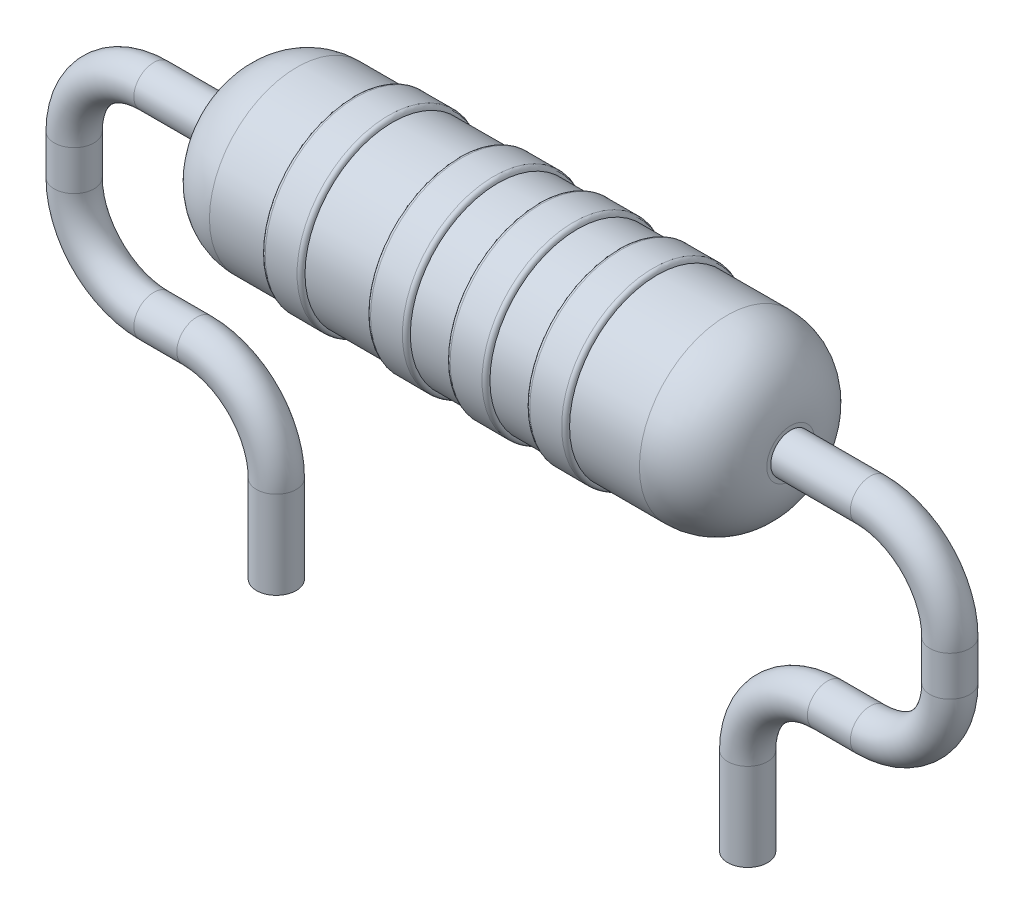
ISO-10303-21;
HEADER;
FILE_DESCRIPTION(('STEP AP214'),'2;1');
FILE_NAME('part.step','',(''),(''),'','','');
FILE_SCHEMA(('AUTOMOTIVE_DESIGN { 1 0 10303 214 1 1 1 1 }'));
ENDSEC;
DATA;
#1=APPLICATION_CONTEXT('core data for automotive mechanical design processes');
#2=APPLICATION_PROTOCOL_DEFINITION('international standard','automotive_design',2000,#1);
#3=PRODUCT_CONTEXT('',#1,'mechanical');
#4=PRODUCT('Part','Part','',(#3));
#5=PRODUCT_RELATED_PRODUCT_CATEGORY('part','',(#4));
#6=PRODUCT_DEFINITION_FORMATION('','',#4);
#7=PRODUCT_DEFINITION_CONTEXT('part definition',#1,'design');
#8=PRODUCT_DEFINITION('design','',#6,#7);
#9=PRODUCT_DEFINITION_SHAPE('','',#8);
#10=(LENGTH_UNIT() NAMED_UNIT(*) SI_UNIT(.MILLI.,.METRE.));
#11=(NAMED_UNIT(*) PLANE_ANGLE_UNIT() SI_UNIT($,.RADIAN.));
#12=(NAMED_UNIT(*) SI_UNIT($,.STERADIAN.) SOLID_ANGLE_UNIT());
#13=UNCERTAINTY_MEASURE_WITH_UNIT(LENGTH_MEASURE(1.E-05),#10,'distance_accuracy_value','');
#14=(GEOMETRIC_REPRESENTATION_CONTEXT(3) GLOBAL_UNCERTAINTY_ASSIGNED_CONTEXT((#13)) GLOBAL_UNIT_ASSIGNED_CONTEXT((#10,
#11,#12)) REPRESENTATION_CONTEXT('',''));
#15=CARTESIAN_POINT('',(0.,0.,0.));
#16=DIRECTION('',(0.,0.,1.));
#17=DIRECTION('',(1.,0.,0.));
#18=AXIS2_PLACEMENT_3D('',#15,#16,#17);
#19=CARTESIAN_POINT('',(-54.2686615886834,0.,0.));
#20=DIRECTION('',(-1.,0.,0.));
#21=DIRECTION('',(0.,0.,1.));
#22=AXIS2_PLACEMENT_3D('',#19,#20,#21);
#23=CYLINDRICAL_SURFACE('',#22,1.1);
#24=CARTESIAN_POINT('',(0.322975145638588,0.,0.));
#25=DIRECTION('',(-1.,0.,0.));
#26=DIRECTION('',(0.,0.,1.));
#27=AXIS2_PLACEMENT_3D('',#24,#25,#26);
#28=CIRCLE('',#27,1.1);
#29=CARTESIAN_POINT('',(0.322975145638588,0.,1.1));
#30=VERTEX_POINT('',#29);
#31=EDGE_CURVE('E86',#30,#30,#28,.T.);
#32=ORIENTED_EDGE('',*,*,#31,.T.);
#33=EDGE_LOOP('',(#32));
#34=FACE_BOUND('',#33,.T.);
#35=CARTESIAN_POINT('',(-0.177024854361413,0.,0.));
#36=DIRECTION('',(1.,0.,0.));
#37=DIRECTION('',(0.,0.,-1.));
#38=AXIS2_PLACEMENT_3D('',#35,#36,#37);
#39=CIRCLE('',#38,1.1);
#40=CARTESIAN_POINT('',(-0.177024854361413,0.,-1.1));
#41=VERTEX_POINT('',#40);
#42=EDGE_CURVE('E95',#41,#41,#39,.T.);
#43=ORIENTED_EDGE('',*,*,#42,.T.);
#44=EDGE_LOOP('',(#43));
#45=FACE_BOUND('',#44,.T.);
#46=ADVANCED_FACE('F39',(#34,#45),#23,.T.);
#47=CARTESIAN_POINT('',(4.3261723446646,0.,0.));
#48=DIRECTION('',(1.,0.,0.));
#49=DIRECTION('',(0.,0.,-1.));
#50=AXIS2_PLACEMENT_3D('',#47,#48,#49);
#51=CYLINDRICAL_SURFACE('',#50,1.15);
#52=CARTESIAN_POINT('',(-0.627024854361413,0.,0.));
#53=DIRECTION('',(-1.,0.,0.));
#54=DIRECTION('',(0.,0.,1.));
#55=AXIS2_PLACEMENT_3D('',#52,#53,#54);
#56=CIRCLE('',#55,1.15);
#57=CARTESIAN_POINT('',(-0.627024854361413,0.,1.15));
#58=VERTEX_POINT('',#57);
#59=EDGE_CURVE('E62',#58,#58,#56,.F.);
#60=ORIENTED_EDGE('',*,*,#59,.T.);
#61=EDGE_LOOP('',(#60));
#62=FACE_BOUND('',#61,.T.);
#63=CARTESIAN_POINT('',(-0.227024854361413,0.,0.));
#64=DIRECTION('',(1.,0.,0.));
#65=DIRECTION('',(0.,0.,-1.));
#66=AXIS2_PLACEMENT_3D('',#63,#64,#65);
#67=CIRCLE('',#66,1.15);
#68=CARTESIAN_POINT('',(-0.227024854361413,0.,-1.15));
#69=VERTEX_POINT('',#68);
#70=EDGE_CURVE('E65',#69,#69,#67,.F.);
#71=ORIENTED_EDGE('',*,*,#70,.T.);
#72=EDGE_LOOP('',(#71));
#73=FACE_BOUND('',#72,.T.);
#74=ADVANCED_FACE('F204',(#62,#73),#51,.T.);
#75=CARTESIAN_POINT('',(-1.5,0.,0.));
#76=DIRECTION('',(1.,0.,0.));
#77=DIRECTION('',(0.,0.,-1.));
#78=AXIS2_PLACEMENT_3D('',#75,#76,#77);
#79=CIRCLE('',#78,1.1);
#80=CARTESIAN_POINT('',(-1.5,0.,-1.1));
#81=VERTEX_POINT('',#80);
#82=EDGE_CURVE('E79',#81,#81,#79,.T.);
#83=ORIENTED_EDGE('',*,*,#82,.T.);
#84=EDGE_LOOP('',(#83));
#85=FACE_BOUND('',#84,.T.);
#86=CARTESIAN_POINT('',(-0.677024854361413,0.,0.));
#87=DIRECTION('',(-1.,0.,0.));
#88=DIRECTION('',(0.,0.,1.));
#89=AXIS2_PLACEMENT_3D('',#86,#87,#88);
#90=CIRCLE('',#89,1.1);
#91=CARTESIAN_POINT('',(-0.677024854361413,0.,1.1));
#92=VERTEX_POINT('',#91);
#93=EDGE_CURVE('E92',#92,#92,#90,.T.);
#94=ORIENTED_EDGE('',*,*,#93,.T.);
#95=EDGE_LOOP('',(#94));
#96=FACE_BOUND('',#95,.T.);
#97=ADVANCED_FACE('F207',(#85,#96),#23,.T.);
#98=CARTESIAN_POINT('',(4.3261723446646,0.,0.));
#99=DIRECTION('',(1.,0.,0.));
#100=DIRECTION('',(0.,0.,-1.));
#101=AXIS2_PLACEMENT_3D('',#98,#99,#100);
#102=CYLINDRICAL_SURFACE('',#101,1.15);
#103=CARTESIAN_POINT('',(0.372975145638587,0.,0.));
#104=DIRECTION('',(-1.,0.,0.));
#105=DIRECTION('',(0.,0.,1.));
#106=AXIS2_PLACEMENT_3D('',#103,#104,#105);
#107=CIRCLE('',#106,1.15);
#108=CARTESIAN_POINT('',(0.372975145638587,0.,1.15));
#109=VERTEX_POINT('',#108);
#110=EDGE_CURVE('E54',#109,#109,#107,.F.);
#111=ORIENTED_EDGE('',*,*,#110,.T.);
#112=EDGE_LOOP('',(#111));
#113=FACE_BOUND('',#112,.T.);
#114=CARTESIAN_POINT('',(0.772975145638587,0.,0.));
#115=DIRECTION('',(1.,0.,0.));
#116=DIRECTION('',(0.,0.,-1.));
#117=AXIS2_PLACEMENT_3D('',#114,#115,#116);
#118=CIRCLE('',#117,1.15);
#119=CARTESIAN_POINT('',(0.772975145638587,0.,-1.15));
#120=VERTEX_POINT('',#119);
#121=EDGE_CURVE('E59',#120,#120,#118,.F.);
#122=ORIENTED_EDGE('',*,*,#121,.T.);
#123=EDGE_LOOP('',(#122));
#124=FACE_BOUND('',#123,.T.);
#125=ADVANCED_FACE('F218',(#113,#124),#102,.T.);
#126=CARTESIAN_POINT('',(1.32297514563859,0.,0.));
#127=DIRECTION('',(-1.,0.,0.));
#128=DIRECTION('',(0.,0.,1.));
#129=AXIS2_PLACEMENT_3D('',#126,#127,#128);
#130=CIRCLE('',#129,1.1);
#131=CARTESIAN_POINT('',(1.32297514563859,0.,1.1));
#132=VERTEX_POINT('',#131);
#133=EDGE_CURVE('E78',#132,#132,#130,.T.);
#134=ORIENTED_EDGE('',*,*,#133,.T.);
#135=EDGE_LOOP('',(#134));
#136=FACE_BOUND('',#135,.T.);
#137=CARTESIAN_POINT('',(0.822975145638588,0.,0.));
#138=DIRECTION('',(1.,0.,0.));
#139=DIRECTION('',(0.,0.,-1.));
#140=AXIS2_PLACEMENT_3D('',#137,#138,#139);
#141=CIRCLE('',#140,1.1);
#142=CARTESIAN_POINT('',(0.822975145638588,0.,-1.1));
#143=VERTEX_POINT('',#142);
#144=EDGE_CURVE('E89',#143,#143,#141,.T.);
#145=ORIENTED_EDGE('',*,*,#144,.T.);
#146=EDGE_LOOP('',(#145));
#147=FACE_BOUND('',#146,.T.);
#148=ADVANCED_FACE('F208',(#136,#147),#23,.T.);
#149=CARTESIAN_POINT('',(4.3261723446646,0.,0.));
#150=DIRECTION('',(1.,0.,0.));
#151=DIRECTION('',(0.,0.,-1.));
#152=AXIS2_PLACEMENT_3D('',#149,#150,#151);
#153=CYLINDRICAL_SURFACE('',#152,1.15);
#154=CARTESIAN_POINT('',(1.37297514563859,0.,0.));
#155=DIRECTION('',(-1.,0.,0.));
#156=DIRECTION('',(0.,0.,1.));
#157=AXIS2_PLACEMENT_3D('',#154,#155,#156);
#158=CIRCLE('',#157,1.15);
#159=CARTESIAN_POINT('',(1.37297514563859,0.,1.15));
#160=VERTEX_POINT('',#159);
#161=EDGE_CURVE('E46',#160,#160,#158,.F.);
#162=ORIENTED_EDGE('',*,*,#161,.T.);
#163=EDGE_LOOP('',(#162));
#164=FACE_BOUND('',#163,.T.);
#165=CARTESIAN_POINT('',(1.77297514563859,0.,0.));
#166=DIRECTION('',(1.,0.,0.));
#167=DIRECTION('',(0.,0.,-1.));
#168=AXIS2_PLACEMENT_3D('',#165,#166,#167);
#169=CIRCLE('',#168,1.15);
#170=CARTESIAN_POINT('',(1.77297514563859,0.,-1.15));
#171=VERTEX_POINT('',#170);
#172=EDGE_CURVE('E50',#171,#171,#169,.F.);
#173=ORIENTED_EDGE('',*,*,#172,.T.);
#174=EDGE_LOOP('',(#173));
#175=FACE_BOUND('',#174,.T.);
#176=ADVANCED_FACE('F222',(#164,#175),#153,.T.);
#177=CARTESIAN_POINT('',(3.5,0.299999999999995,0.));
#178=DIRECTION('',(-1.,0.,0.));
#179=DIRECTION('',(0.,0.,1.));
#180=AXIS2_PLACEMENT_3D('',#177,#178,#179);
#181=PLANE('',#180);
#182=CARTESIAN_POINT('',(3.5,0.,0.));
#183=DIRECTION('',(-1.,0.,0.));
#184=DIRECTION('',(0.,0.,1.));
#185=AXIS2_PLACEMENT_3D('',#182,#183,#184);
#186=CIRCLE('',#185,0.25);
#187=CARTESIAN_POINT('',(3.5,0.,0.25));
#188=VERTEX_POINT('',#187);
#189=EDGE_CURVE('E150',#188,#188,#186,.T.);
#190=ORIENTED_EDGE('',*,*,#189,.T.);
#191=EDGE_LOOP('',(#190));
#192=FACE_BOUND('',#191,.T.);
#193=CARTESIAN_POINT('',(3.5,0.,0.));
#194=DIRECTION('',(-1.,0.,0.));
#195=DIRECTION('',(0.,0.,1.));
#196=AXIS2_PLACEMENT_3D('',#193,#194,#195);
#197=CIRCLE('',#196,0.299999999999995);
#198=CARTESIAN_POINT('',(3.5,0.,0.299999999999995));
#199=VERTEX_POINT('',#198);
#200=EDGE_CURVE('E74',#199,#199,#197,.T.);
#201=ORIENTED_EDGE('',*,*,#200,.F.);
#202=EDGE_LOOP('',(#201));
#203=FACE_BOUND('',#202,.T.);
#204=ADVANCED_FACE('F229',(#192,#203),#181,.F.);
#205=CARTESIAN_POINT('',(2.7,0.,0.));
#206=DIRECTION('',(-1.,0.,0.));
#207=DIRECTION('',(0.,0.,1.));
#208=AXIS2_PLACEMENT_3D('',#205,#206,#207);
#209=DEGENERATE_TOROIDAL_SURFACE('',#208,0.3,0.8,.T.);
#210=CARTESIAN_POINT('',(2.69999999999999,0.,0.));
#211=DIRECTION('',(-1.,0.,0.));
#212=DIRECTION('',(0.,0.,1.));
#213=AXIS2_PLACEMENT_3D('',#210,#211,#212);
#214=CIRCLE('',#213,1.1);
#215=CARTESIAN_POINT('',(2.69999999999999,0.,1.1));
#216=VERTEX_POINT('',#215);
#217=EDGE_CURVE('E103',#216,#216,#214,.T.);
#218=ORIENTED_EDGE('',*,*,#217,.F.);
#219=EDGE_LOOP('',(#218));
#220=FACE_BOUND('',#219,.T.);
#221=ORIENTED_EDGE('',*,*,#200,.T.);
#222=EDGE_LOOP('',(#221));
#223=FACE_BOUND('',#222,.T.);
#224=ADVANCED_FACE('F236',(#220,#223),#209,.T.);
#225=CARTESIAN_POINT('',(1.82297514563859,0.,0.));
#226=DIRECTION('',(1.,0.,0.));
#227=DIRECTION('',(0.,0.,-1.));
#228=AXIS2_PLACEMENT_3D('',#225,#226,#227);
#229=CIRCLE('',#228,1.1);
#230=CARTESIAN_POINT('',(1.82297514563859,0.,-1.1));
#231=VERTEX_POINT('',#230);
#232=EDGE_CURVE('E83',#231,#231,#229,.T.);
#233=ORIENTED_EDGE('',*,*,#232,.T.);
#234=EDGE_LOOP('',(#233));
#235=FACE_BOUND('',#234,.T.);
#236=ORIENTED_EDGE('',*,*,#217,.T.);
#237=EDGE_LOOP('',(#236));
#238=FACE_BOUND('',#237,.T.);
#239=ADVANCED_FACE('F224',(#235,#238),#23,.T.);
#240=CARTESIAN_POINT('',(4.3261723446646,0.,0.));
#241=DIRECTION('',(1.,0.,0.));
#242=DIRECTION('',(0.,0.,-1.));
#243=AXIS2_PLACEMENT_3D('',#240,#241,#242);
#244=CYLINDRICAL_SURFACE('',#243,1.15);
#245=CARTESIAN_POINT('',(-1.95,0.,0.));
#246=DIRECTION('',(-1.,0.,0.));
#247=DIRECTION('',(0.,0.,1.));
#248=AXIS2_PLACEMENT_3D('',#245,#246,#247);
#249=CIRCLE('',#248,1.15);
#250=CARTESIAN_POINT('',(-1.95,0.,1.15));
#251=VERTEX_POINT('',#250);
#252=EDGE_CURVE('E68',#251,#251,#249,.F.);
#253=ORIENTED_EDGE('',*,*,#252,.T.);
#254=EDGE_LOOP('',(#253));
#255=FACE_BOUND('',#254,.T.);
#256=CARTESIAN_POINT('',(-1.55,0.,0.));
#257=DIRECTION('',(1.,0.,0.));
#258=DIRECTION('',(0.,0.,-1.));
#259=AXIS2_PLACEMENT_3D('',#256,#257,#258);
#260=CIRCLE('',#259,1.15);
#261=CARTESIAN_POINT('',(-1.55,0.,-1.15));
#262=VERTEX_POINT('',#261);
#263=EDGE_CURVE('E71',#262,#262,#260,.F.);
#264=ORIENTED_EDGE('',*,*,#263,.T.);
#265=EDGE_LOOP('',(#264));
#266=FACE_BOUND('',#265,.T.);
#267=ADVANCED_FACE('F235',(#255,#266),#244,.T.);
#268=CARTESIAN_POINT('',(-3.5,0.,0.));
#269=DIRECTION('',(1.,0.,0.));
#270=DIRECTION('',(0.,0.,-1.));
#271=AXIS2_PLACEMENT_3D('',#268,#269,#270);
#272=PLANE('',#271);
#273=CARTESIAN_POINT('',(-3.5,0.,0.));
#274=DIRECTION('',(1.,0.,0.));
#275=DIRECTION('',(0.,0.,-1.));
#276=AXIS2_PLACEMENT_3D('',#273,#274,#275);
#277=CIRCLE('',#276,0.25);
#278=CARTESIAN_POINT('',(-3.5,0.,-0.25));
#279=VERTEX_POINT('',#278);
#280=EDGE_CURVE('E10',#279,#279,#277,.F.);
#281=ORIENTED_EDGE('',*,*,#280,.F.);
#282=EDGE_LOOP('',(#281));
#283=FACE_BOUND('',#282,.T.);
#284=CARTESIAN_POINT('',(-3.5,0.,0.));
#285=DIRECTION('',(-1.,0.,0.));
#286=DIRECTION('',(0.,0.,1.));
#287=AXIS2_PLACEMENT_3D('',#284,#285,#286);
#288=CIRCLE('',#287,0.299999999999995);
#289=CARTESIAN_POINT('',(-3.5,0.,0.299999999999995));
#290=VERTEX_POINT('',#289);
#291=EDGE_CURVE('E98',#290,#290,#288,.T.);
#292=ORIENTED_EDGE('',*,*,#291,.T.);
#293=EDGE_LOOP('',(#292));
#294=FACE_BOUND('',#293,.T.);
#295=ADVANCED_FACE('F242',(#283,#294),#272,.F.);
#296=CARTESIAN_POINT('',(-2.7,0.,0.));
#297=DIRECTION('',(-1.,0.,0.));
#298=DIRECTION('',(0.,0.,1.));
#299=AXIS2_PLACEMENT_3D('',#296,#297,#298);
#300=DEGENERATE_TOROIDAL_SURFACE('',#299,0.3,0.8,.T.);
#301=ORIENTED_EDGE('',*,*,#291,.F.);
#302=EDGE_LOOP('',(#301));
#303=FACE_BOUND('',#302,.T.);
#304=CARTESIAN_POINT('',(-2.69999999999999,0.,0.));
#305=DIRECTION('',(-1.,0.,0.));
#306=DIRECTION('',(0.,0.,1.));
#307=AXIS2_PLACEMENT_3D('',#304,#305,#306);
#308=CIRCLE('',#307,1.1);
#309=CARTESIAN_POINT('',(-2.69999999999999,0.,1.1));
#310=VERTEX_POINT('',#309);
#311=EDGE_CURVE('E106',#310,#310,#308,.T.);
#312=ORIENTED_EDGE('',*,*,#311,.T.);
#313=EDGE_LOOP('',(#312));
#314=FACE_BOUND('',#313,.T.);
#315=ADVANCED_FACE('F249',(#303,#314),#300,.T.);
#316=CARTESIAN_POINT('',(-2.,0.,0.));
#317=DIRECTION('',(-1.,0.,0.));
#318=DIRECTION('',(0.,0.,1.));
#319=AXIS2_PLACEMENT_3D('',#316,#317,#318);
#320=CIRCLE('',#319,1.1);
#321=CARTESIAN_POINT('',(-2.,0.,1.1));
#322=VERTEX_POINT('',#321);
#323=EDGE_CURVE('E75',#322,#322,#320,.T.);
#324=ORIENTED_EDGE('',*,*,#323,.T.);
#325=EDGE_LOOP('',(#324));
#326=FACE_BOUND('',#325,.T.);
#327=ORIENTED_EDGE('',*,*,#311,.F.);
#328=EDGE_LOOP('',(#327));
#329=FACE_BOUND('',#328,.T.);
#330=ADVANCED_FACE('F220',(#326,#329),#23,.T.);
#331=CARTESIAN_POINT('',(-1.95,0.,0.));
#332=DIRECTION('',(-1.,0.,0.));
#333=DIRECTION('',(0.,0.,1.));
#334=AXIS2_PLACEMENT_3D('',#331,#332,#333);
#335=TOROIDAL_SURFACE('',#334,1.1,0.05);
#336=ORIENTED_EDGE('',*,*,#323,.F.);
#337=EDGE_LOOP('',(#336));
#338=FACE_BOUND('',#337,.T.);
#339=ORIENTED_EDGE('',*,*,#252,.F.);
#340=EDGE_LOOP('',(#339));
#341=FACE_BOUND('',#340,.T.);
#342=ADVANCED_FACE('F248',(#338,#341),#335,.T.);
#343=CARTESIAN_POINT('',(-1.55,0.,0.));
#344=DIRECTION('',(1.,0.,0.));
#345=DIRECTION('',(0.,0.,-1.));
#346=AXIS2_PLACEMENT_3D('',#343,#344,#345);
#347=TOROIDAL_SURFACE('',#346,1.1,0.05);
#348=ORIENTED_EDGE('',*,*,#263,.F.);
#349=EDGE_LOOP('',(#348));
#350=FACE_BOUND('',#349,.T.);
#351=ORIENTED_EDGE('',*,*,#82,.F.);
#352=EDGE_LOOP('',(#351));
#353=FACE_BOUND('',#352,.T.);
#354=ADVANCED_FACE('F255',(#350,#353),#347,.T.);
#355=CARTESIAN_POINT('',(-0.627024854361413,0.,0.));
#356=DIRECTION('',(-1.,0.,0.));
#357=DIRECTION('',(0.,0.,1.));
#358=AXIS2_PLACEMENT_3D('',#355,#356,#357);
#359=TOROIDAL_SURFACE('',#358,1.1,0.05);
#360=ORIENTED_EDGE('',*,*,#93,.F.);
#361=EDGE_LOOP('',(#360));
#362=FACE_BOUND('',#361,.T.);
#363=ORIENTED_EDGE('',*,*,#59,.F.);
#364=EDGE_LOOP('',(#363));
#365=FACE_BOUND('',#364,.T.);
#366=ADVANCED_FACE('F270',(#362,#365),#359,.T.);
#367=CARTESIAN_POINT('',(-0.227024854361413,0.,0.));
#368=DIRECTION('',(1.,0.,0.));
#369=DIRECTION('',(0.,0.,-1.));
#370=AXIS2_PLACEMENT_3D('',#367,#368,#369);
#371=TOROIDAL_SURFACE('',#370,1.1,0.05);
#372=ORIENTED_EDGE('',*,*,#70,.F.);
#373=EDGE_LOOP('',(#372));
#374=FACE_BOUND('',#373,.T.);
#375=ORIENTED_EDGE('',*,*,#42,.F.);
#376=EDGE_LOOP('',(#375));
#377=FACE_BOUND('',#376,.T.);
#378=ADVANCED_FACE('F278',(#374,#377),#371,.T.);
#379=CARTESIAN_POINT('',(0.372975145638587,0.,0.));
#380=DIRECTION('',(-1.,0.,0.));
#381=DIRECTION('',(0.,0.,1.));
#382=AXIS2_PLACEMENT_3D('',#379,#380,#381);
#383=TOROIDAL_SURFACE('',#382,1.1,0.05);
#384=ORIENTED_EDGE('',*,*,#31,.F.);
#385=EDGE_LOOP('',(#384));
#386=FACE_BOUND('',#385,.T.);
#387=ORIENTED_EDGE('',*,*,#110,.F.);
#388=EDGE_LOOP('',(#387));
#389=FACE_BOUND('',#388,.T.);
#390=ADVANCED_FACE('F286',(#386,#389),#383,.T.);
#391=CARTESIAN_POINT('',(0.772975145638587,0.,0.));
#392=DIRECTION('',(1.,0.,0.));
#393=DIRECTION('',(0.,0.,-1.));
#394=AXIS2_PLACEMENT_3D('',#391,#392,#393);
#395=TOROIDAL_SURFACE('',#394,1.1,0.05);
#396=ORIENTED_EDGE('',*,*,#121,.F.);
#397=EDGE_LOOP('',(#396));
#398=FACE_BOUND('',#397,.T.);
#399=ORIENTED_EDGE('',*,*,#144,.F.);
#400=EDGE_LOOP('',(#399));
#401=FACE_BOUND('',#400,.T.);
#402=ADVANCED_FACE('F292',(#398,#401),#395,.T.);
#403=CARTESIAN_POINT('',(1.37297514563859,0.,0.));
#404=DIRECTION('',(-1.,0.,0.));
#405=DIRECTION('',(0.,0.,1.));
#406=AXIS2_PLACEMENT_3D('',#403,#404,#405);
#407=TOROIDAL_SURFACE('',#406,1.1,0.05);
#408=ORIENTED_EDGE('',*,*,#133,.F.);
#409=EDGE_LOOP('',(#408));
#410=FACE_BOUND('',#409,.T.);
#411=ORIENTED_EDGE('',*,*,#161,.F.);
#412=EDGE_LOOP('',(#411));
#413=FACE_BOUND('',#412,.T.);
#414=ADVANCED_FACE('F297',(#410,#413),#407,.T.);
#415=CARTESIAN_POINT('',(1.77297514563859,0.,0.));
#416=DIRECTION('',(1.,0.,0.));
#417=DIRECTION('',(0.,0.,-1.));
#418=AXIS2_PLACEMENT_3D('',#415,#416,#417);
#419=TOROIDAL_SURFACE('',#418,1.1,0.05);
#420=ORIENTED_EDGE('',*,*,#172,.F.);
#421=EDGE_LOOP('',(#420));
#422=FACE_BOUND('',#421,.T.);
#423=ORIENTED_EDGE('',*,*,#232,.F.);
#424=EDGE_LOOP('',(#423));
#425=FACE_BOUND('',#424,.T.);
#426=ADVANCED_FACE('F41',(#422,#425),#419,.T.);
#427=CARTESIAN_POINT('',(-2.96,-3.50000000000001,0.));
#428=DIRECTION('',(0.,-1.,0.));
#429=DIRECTION('',(1.,0.,0.));
#430=AXIS2_PLACEMENT_3D('',#427,#428,#429);
#431=CYLINDRICAL_SURFACE('',#430,0.25);
#432=CARTESIAN_POINT('',(-2.96,-3.50000000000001,0.));
#433=DIRECTION('',(0.,-1.,0.));
#434=DIRECTION('',(0.,0.,1.));
#435=AXIS2_PLACEMENT_3D('',#432,#433,#434);
#436=CIRCLE('',#435,0.25);
#437=CARTESIAN_POINT('',(-2.71,-3.50000000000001,0.));
#438=VERTEX_POINT('',#437);
#439=EDGE_CURVE('E113',#438,#438,#436,.T.);
#440=ORIENTED_EDGE('',*,*,#439,.T.);
#441=EDGE_LOOP('',(#440));
#442=FACE_BOUND('',#441,.T.);
#443=CARTESIAN_POINT('',(-2.96,-4.6,0.));
#444=DIRECTION('',(0.,-1.,0.));
#445=DIRECTION('',(0.,0.,1.));
#446=AXIS2_PLACEMENT_3D('',#443,#444,#445);
#447=CIRCLE('',#446,0.25);
#448=CARTESIAN_POINT('',(-2.96,-4.6,0.25));
#449=VERTEX_POINT('',#448);
#450=EDGE_CURVE('E82',#449,#449,#447,.T.);
#451=ORIENTED_EDGE('',*,*,#450,.F.);
#452=EDGE_LOOP('',(#451));
#453=FACE_BOUND('',#452,.T.);
#454=ADVANCED_FACE('F304',(#442,#453),#431,.T.);
#455=CARTESIAN_POINT('',(-3.96,-3.5,0.));
#456=DIRECTION('',(0.,0.,-1.));
#457=DIRECTION('',(-1.,0.,0.));
#458=AXIS2_PLACEMENT_3D('',#455,#456,#457);
#459=TOROIDAL_SURFACE('',#458,1.,0.25);
#460=CARTESIAN_POINT('',(-3.96000000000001,-2.5,0.));
#461=DIRECTION('',(1.,0.,0.));
#462=DIRECTION('',(0.,0.,1.));
#463=AXIS2_PLACEMENT_3D('',#460,#461,#462);
#464=CIRCLE('',#463,0.25);
#465=CARTESIAN_POINT('',(-3.96000000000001,-2.25,0.));
#466=VERTEX_POINT('',#465);
#467=EDGE_CURVE('E116',#466,#466,#464,.T.);
#468=CARTESIAN_POINT('',(-3.96,-3.5,0.));
#469=DIRECTION('',(0.,0.,-1.));
#470=DIRECTION('',(-1.,0.,0.));
#471=AXIS2_PLACEMENT_3D('',#468,#469,#470);
#472=CIRCLE('',#471,1.25);
#473=EDGE_CURVE('',#466,#438,#472,.T.);
#474=ORIENTED_EDGE('',*,*,#467,.T.);
#475=ORIENTED_EDGE('',*,*,#439,.F.);
#476=ORIENTED_EDGE('',*,*,#473,.T.);
#477=ORIENTED_EDGE('',*,*,#473,.F.);
#478=EDGE_LOOP('',(#474,#476,#475,#477));
#479=FACE_BOUND('',#478,.T.);
#480=ADVANCED_FACE('F311',(#479),#459,.T.);
#481=CARTESIAN_POINT('',(-4.49999999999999,-2.5,0.));
#482=DIRECTION('',(1.,0.,0.));
#483=DIRECTION('',(0.,1.,0.));
#484=AXIS2_PLACEMENT_3D('',#481,#482,#483);
#485=CYLINDRICAL_SURFACE('',#484,0.25);
#486=CARTESIAN_POINT('',(-4.49999999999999,-2.5,0.));
#487=DIRECTION('',(1.,0.,0.));
#488=DIRECTION('',(0.,0.,1.));
#489=AXIS2_PLACEMENT_3D('',#486,#487,#488);
#490=CIRCLE('',#489,0.25);
#491=CARTESIAN_POINT('',(-4.49999999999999,-2.75,0.));
#492=VERTEX_POINT('',#491);
#493=EDGE_CURVE('E119',#492,#492,#490,.T.);
#494=ORIENTED_EDGE('',*,*,#493,.T.);
#495=EDGE_LOOP('',(#494));
#496=FACE_BOUND('',#495,.T.);
#497=ORIENTED_EDGE('',*,*,#467,.F.);
#498=EDGE_LOOP('',(#497));
#499=FACE_BOUND('',#498,.T.);
#500=ADVANCED_FACE('F321',(#496,#499),#485,.T.);
#501=CARTESIAN_POINT('',(-4.5,-1.5,0.));
#502=DIRECTION('',(0.,0.,1.));
#503=DIRECTION('',(1.,0.,0.));
#504=AXIS2_PLACEMENT_3D('',#501,#502,#503);
#505=TOROIDAL_SURFACE('',#504,1.,0.25);
#506=CARTESIAN_POINT('',(-5.5,-1.49999999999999,0.));
#507=DIRECTION('',(0.,-1.,0.));
#508=DIRECTION('',(0.,0.,1.));
#509=AXIS2_PLACEMENT_3D('',#506,#507,#508);
#510=CIRCLE('',#509,0.25);
#511=CARTESIAN_POINT('',(-5.75,-1.49999999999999,0.));
#512=VERTEX_POINT('',#511);
#513=EDGE_CURVE('E122',#512,#512,#510,.T.);
#514=CARTESIAN_POINT('',(-4.5,-1.5,0.));
#515=DIRECTION('',(0.,0.,1.));
#516=DIRECTION('',(1.,0.,0.));
#517=AXIS2_PLACEMENT_3D('',#514,#515,#516);
#518=CIRCLE('',#517,1.25);
#519=EDGE_CURVE('',#512,#492,#518,.T.);
#520=ORIENTED_EDGE('',*,*,#513,.T.);
#521=ORIENTED_EDGE('',*,*,#493,.F.);
#522=ORIENTED_EDGE('',*,*,#519,.T.);
#523=ORIENTED_EDGE('',*,*,#519,.F.);
#524=EDGE_LOOP('',(#520,#522,#521,#523));
#525=FACE_BOUND('',#524,.T.);
#526=ADVANCED_FACE('F464',(#525),#505,.T.);
#527=CARTESIAN_POINT('',(-5.5,-1.00000000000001,0.));
#528=DIRECTION('',(0.,-1.,0.));
#529=DIRECTION('',(0.,0.,-1.));
#530=AXIS2_PLACEMENT_3D('',#527,#528,#529);
#531=CYLINDRICAL_SURFACE('',#530,0.25);
#532=CARTESIAN_POINT('',(-5.5,-1.00000000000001,0.));
#533=DIRECTION('',(0.,-1.,0.));
#534=DIRECTION('',(0.,0.,1.));
#535=AXIS2_PLACEMENT_3D('',#532,#533,#534);
#536=CIRCLE('',#535,0.25);
#537=CARTESIAN_POINT('',(-5.75,-1.00000000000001,0.));
#538=VERTEX_POINT('',#537);
#539=EDGE_CURVE('E125',#538,#538,#536,.T.);
#540=ORIENTED_EDGE('',*,*,#539,.T.);
#541=EDGE_LOOP('',(#540));
#542=FACE_BOUND('',#541,.T.);
#543=ORIENTED_EDGE('',*,*,#513,.F.);
#544=EDGE_LOOP('',(#543));
#545=FACE_BOUND('',#544,.T.);
#546=ADVANCED_FACE('F472',(#542,#545),#531,.T.);
#547=CARTESIAN_POINT('',(-4.5,-1.,0.));
#548=DIRECTION('',(0.,0.,1.));
#549=DIRECTION('',(1.,0.,0.));
#550=AXIS2_PLACEMENT_3D('',#547,#548,#549);
#551=TOROIDAL_SURFACE('',#550,1.,0.25);
#552=CARTESIAN_POINT('',(-4.49999999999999,0.,0.));
#553=DIRECTION('',(-1.,0.,0.));
#554=DIRECTION('',(0.,0.,1.));
#555=AXIS2_PLACEMENT_3D('',#552,#553,#554);
#556=CIRCLE('',#555,0.25);
#557=CARTESIAN_POINT('',(-4.49999999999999,0.25,0.));
#558=VERTEX_POINT('',#557);
#559=EDGE_CURVE('E128',#558,#558,#556,.T.);
#560=CARTESIAN_POINT('',(-4.5,-1.,0.));
#561=DIRECTION('',(0.,0.,1.));
#562=DIRECTION('',(1.,0.,0.));
#563=AXIS2_PLACEMENT_3D('',#560,#561,#562);
#564=CIRCLE('',#563,1.25);
#565=EDGE_CURVE('',#558,#538,#564,.T.);
#566=ORIENTED_EDGE('',*,*,#559,.T.);
#567=ORIENTED_EDGE('',*,*,#539,.F.);
#568=ORIENTED_EDGE('',*,*,#565,.T.);
#569=ORIENTED_EDGE('',*,*,#565,.F.);
#570=EDGE_LOOP('',(#566,#568,#567,#569));
#571=FACE_BOUND('',#570,.T.);
#572=ADVANCED_FACE('F481',(#571),#551,.T.);
#573=CARTESIAN_POINT('',(-4.49999999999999,0.,0.));
#574=DIRECTION('',(1.,0.,0.));
#575=DIRECTION('',(0.,0.,-1.));
#576=AXIS2_PLACEMENT_3D('',#573,#574,#575);
#577=CYLINDRICAL_SURFACE('',#576,0.25);
#578=ORIENTED_EDGE('',*,*,#559,.F.);
#579=EDGE_LOOP('',(#578));
#580=FACE_BOUND('',#579,.T.);
#581=ORIENTED_EDGE('',*,*,#280,.T.);
#582=EDGE_LOOP('',(#581));
#583=FACE_BOUND('',#582,.T.);
#584=ADVANCED_FACE('F490',(#580,#583),#577,.T.);
#585=CARTESIAN_POINT('',(-2.96,-4.6,0.));
#586=DIRECTION('',(0.,-1.,0.));
#587=DIRECTION('',(0.,0.,1.));
#588=AXIS2_PLACEMENT_3D('',#585,#586,#587);
#589=PLANE('',#588);
#590=ORIENTED_EDGE('',*,*,#450,.T.);
#591=EDGE_LOOP('',(#590));
#592=FACE_BOUND('',#591,.T.);
#593=ADVANCED_FACE('F192',(#592),#589,.T.);
#594=CARTESIAN_POINT('',(2.96,-3.50000000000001,0.));
#595=DIRECTION('',(0.,-1.,0.));
#596=DIRECTION('',(1.,0.,0.));
#597=AXIS2_PLACEMENT_3D('',#594,#595,#596);
#598=CYLINDRICAL_SURFACE('',#597,0.25);
#599=CARTESIAN_POINT('',(2.96,-3.50000000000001,0.));
#600=DIRECTION('',(0.,1.,0.));
#601=DIRECTION('',(0.,0.,1.));
#602=AXIS2_PLACEMENT_3D('',#599,#600,#601);
#603=CIRCLE('',#602,0.25);
#604=CARTESIAN_POINT('',(2.71,-3.50000000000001,0.));
#605=VERTEX_POINT('',#604);
#606=EDGE_CURVE('E134',#605,#605,#603,.T.);
#607=ORIENTED_EDGE('',*,*,#606,.F.);
#608=EDGE_LOOP('',(#607));
#609=FACE_BOUND('',#608,.T.);
#610=CARTESIAN_POINT('',(2.96,-4.6,0.));
#611=DIRECTION('',(0.,1.,0.));
#612=DIRECTION('',(0.,0.,1.));
#613=AXIS2_PLACEMENT_3D('',#610,#611,#612);
#614=CIRCLE('',#613,0.25);
#615=CARTESIAN_POINT('',(2.96,-4.6,0.25));
#616=VERTEX_POINT('',#615);
#617=EDGE_CURVE('E131',#616,#616,#614,.T.);
#618=ORIENTED_EDGE('',*,*,#617,.T.);
#619=EDGE_LOOP('',(#618));
#620=FACE_BOUND('',#619,.T.);
#621=ADVANCED_FACE('F186',(#609,#620),#598,.T.);
#622=CARTESIAN_POINT('',(3.96,-3.5,0.));
#623=DIRECTION('',(0.,0.,1.));
#624=DIRECTION('',(1.,0.,0.));
#625=AXIS2_PLACEMENT_3D('',#622,#623,#624);
#626=TOROIDAL_SURFACE('',#625,1.,0.25);
#627=CARTESIAN_POINT('',(3.96000000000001,-2.5,0.));
#628=DIRECTION('',(1.,0.,0.));
#629=DIRECTION('',(0.,0.,1.));
#630=AXIS2_PLACEMENT_3D('',#627,#628,#629);
#631=CIRCLE('',#630,0.25);
#632=CARTESIAN_POINT('',(3.96000000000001,-2.25,0.));
#633=VERTEX_POINT('',#632);
#634=EDGE_CURVE('E137',#633,#633,#631,.T.);
#635=CARTESIAN_POINT('',(3.96,-3.5,0.));
#636=DIRECTION('',(0.,0.,1.));
#637=DIRECTION('',(1.,0.,0.));
#638=AXIS2_PLACEMENT_3D('',#635,#636,#637);
#639=CIRCLE('',#638,1.25);
#640=EDGE_CURVE('',#633,#605,#639,.T.);
#641=ORIENTED_EDGE('',*,*,#634,.F.);
#642=ORIENTED_EDGE('',*,*,#606,.T.);
#643=ORIENTED_EDGE('',*,*,#640,.T.);
#644=ORIENTED_EDGE('',*,*,#640,.F.);
#645=EDGE_LOOP('',(#641,#643,#642,#644));
#646=FACE_BOUND('',#645,.T.);
#647=ADVANCED_FACE('F180',(#646),#626,.T.);
#648=CARTESIAN_POINT('',(4.49999999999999,-2.5,0.));
#649=DIRECTION('',(-1.,0.,0.));
#650=DIRECTION('',(0.,-1.,0.));
#651=AXIS2_PLACEMENT_3D('',#648,#649,#650);
#652=CYLINDRICAL_SURFACE('',#651,0.25);
#653=CARTESIAN_POINT('',(4.49999999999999,-2.5,0.));
#654=DIRECTION('',(1.,0.,0.));
#655=DIRECTION('',(0.,0.,1.));
#656=AXIS2_PLACEMENT_3D('',#653,#654,#655);
#657=CIRCLE('',#656,0.25);
#658=CARTESIAN_POINT('',(4.49999999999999,-2.75,0.));
#659=VERTEX_POINT('',#658);
#660=EDGE_CURVE('E140',#659,#659,#657,.T.);
#661=ORIENTED_EDGE('',*,*,#660,.F.);
#662=EDGE_LOOP('',(#661));
#663=FACE_BOUND('',#662,.T.);
#664=ORIENTED_EDGE('',*,*,#634,.T.);
#665=EDGE_LOOP('',(#664));
#666=FACE_BOUND('',#665,.T.);
#667=ADVANCED_FACE('F174',(#663,#666),#652,.T.);
#668=CARTESIAN_POINT('',(4.5,-1.5,0.));
#669=DIRECTION('',(0.,0.,-1.));
#670=DIRECTION('',(-1.,0.,0.));
#671=AXIS2_PLACEMENT_3D('',#668,#669,#670);
#672=TOROIDAL_SURFACE('',#671,1.,0.25);
#673=CARTESIAN_POINT('',(5.5,-1.49999999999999,0.));
#674=DIRECTION('',(0.,1.,0.));
#675=DIRECTION('',(0.,0.,1.));
#676=AXIS2_PLACEMENT_3D('',#673,#674,#675);
#677=CIRCLE('',#676,0.25);
#678=CARTESIAN_POINT('',(5.75,-1.49999999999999,0.));
#679=VERTEX_POINT('',#678);
#680=EDGE_CURVE('E143',#679,#679,#677,.T.);
#681=CARTESIAN_POINT('',(4.5,-1.5,0.));
#682=DIRECTION('',(0.,0.,-1.));
#683=DIRECTION('',(-1.,0.,0.));
#684=AXIS2_PLACEMENT_3D('',#681,#682,#683);
#685=CIRCLE('',#684,1.25);
#686=EDGE_CURVE('',#679,#659,#685,.T.);
#687=ORIENTED_EDGE('',*,*,#680,.F.);
#688=ORIENTED_EDGE('',*,*,#660,.T.);
#689=ORIENTED_EDGE('',*,*,#686,.T.);
#690=ORIENTED_EDGE('',*,*,#686,.F.);
#691=EDGE_LOOP('',(#687,#689,#688,#690));
#692=FACE_BOUND('',#691,.T.);
#693=ADVANCED_FACE('F168',(#692),#672,.T.);
#694=CARTESIAN_POINT('',(5.5,-1.00000000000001,0.));
#695=DIRECTION('',(0.,-1.,0.));
#696=DIRECTION('',(0.,0.,-1.));
#697=AXIS2_PLACEMENT_3D('',#694,#695,#696);
#698=CYLINDRICAL_SURFACE('',#697,0.25);
#699=CARTESIAN_POINT('',(5.5,-1.00000000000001,0.));
#700=DIRECTION('',(0.,1.,0.));
#701=DIRECTION('',(0.,0.,1.));
#702=AXIS2_PLACEMENT_3D('',#699,#700,#701);
#703=CIRCLE('',#702,0.25);
#704=CARTESIAN_POINT('',(5.75,-1.00000000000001,0.));
#705=VERTEX_POINT('',#704);
#706=EDGE_CURVE('E146',#705,#705,#703,.T.);
#707=ORIENTED_EDGE('',*,*,#706,.F.);
#708=EDGE_LOOP('',(#707));
#709=FACE_BOUND('',#708,.T.);
#710=ORIENTED_EDGE('',*,*,#680,.T.);
#711=EDGE_LOOP('',(#710));
#712=FACE_BOUND('',#711,.T.);
#713=ADVANCED_FACE('F162',(#709,#712),#698,.T.);
#714=CARTESIAN_POINT('',(4.5,-1.,0.));
#715=DIRECTION('',(0.,0.,-1.));
#716=DIRECTION('',(-1.,0.,0.));
#717=AXIS2_PLACEMENT_3D('',#714,#715,#716);
#718=TOROIDAL_SURFACE('',#717,1.,0.25);
#719=CARTESIAN_POINT('',(4.49999999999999,0.,0.));
#720=DIRECTION('',(-1.,0.,0.));
#721=DIRECTION('',(0.,0.,1.));
#722=AXIS2_PLACEMENT_3D('',#719,#720,#721);
#723=CIRCLE('',#722,0.25);
#724=CARTESIAN_POINT('',(4.49999999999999,0.25,0.));
#725=VERTEX_POINT('',#724);
#726=EDGE_CURVE('E149',#725,#725,#723,.T.);
#727=CARTESIAN_POINT('',(4.5,-1.,0.));
#728=DIRECTION('',(0.,0.,-1.));
#729=DIRECTION('',(-1.,0.,0.));
#730=AXIS2_PLACEMENT_3D('',#727,#728,#729);
#731=CIRCLE('',#730,1.25);
#732=EDGE_CURVE('',#725,#705,#731,.T.);
#733=ORIENTED_EDGE('',*,*,#726,.F.);
#734=ORIENTED_EDGE('',*,*,#706,.T.);
#735=ORIENTED_EDGE('',*,*,#732,.T.);
#736=ORIENTED_EDGE('',*,*,#732,.F.);
#737=EDGE_LOOP('',(#733,#735,#734,#736));
#738=FACE_BOUND('',#737,.T.);
#739=ADVANCED_FACE('F159',(#738),#718,.T.);
#740=CARTESIAN_POINT('',(4.49999999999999,0.,0.));
#741=DIRECTION('',(-1.,0.,0.));
#742=DIRECTION('',(0.,0.,1.));
#743=AXIS2_PLACEMENT_3D('',#740,#741,#742);
#744=CYLINDRICAL_SURFACE('',#743,0.25);
#745=ORIENTED_EDGE('',*,*,#726,.T.);
#746=EDGE_LOOP('',(#745));
#747=FACE_BOUND('',#746,.T.);
#748=ORIENTED_EDGE('',*,*,#189,.F.);
#749=EDGE_LOOP('',(#748));
#750=FACE_BOUND('',#749,.T.);
#751=ADVANCED_FACE('F156',(#747,#750),#744,.T.);
#752=CARTESIAN_POINT('',(2.96,-4.6,0.));
#753=DIRECTION('',(0.,-1.,0.));
#754=DIRECTION('',(0.,0.,1.));
#755=AXIS2_PLACEMENT_3D('',#752,#753,#754);
#756=PLANE('',#755);
#757=ORIENTED_EDGE('',*,*,#617,.F.);
#758=EDGE_LOOP('',(#757));
#759=FACE_BOUND('',#758,.T.);
#760=ADVANCED_FACE('F196',(#759),#756,.T.);
#761=CLOSED_SHELL('',(#46,#74,#97,#125,#148,#176,#204,#224,#239,#267,#295,#315,#330,#342,#354,
#366,#378,#390,#402,#414,#426,#454,#480,#500,#526,#546,#572,#584,#593,#621,#647,#667,#693,#713,
#739,#751,#760));
#762=MANIFOLD_SOLID_BREP('B2',#761);
#763=ADVANCED_BREP_SHAPE_REPRESENTATION('',(#18,#762),#14);
#764=SHAPE_DEFINITION_REPRESENTATION(#9,#763);
ENDSEC;
END-ISO-10303-21;
